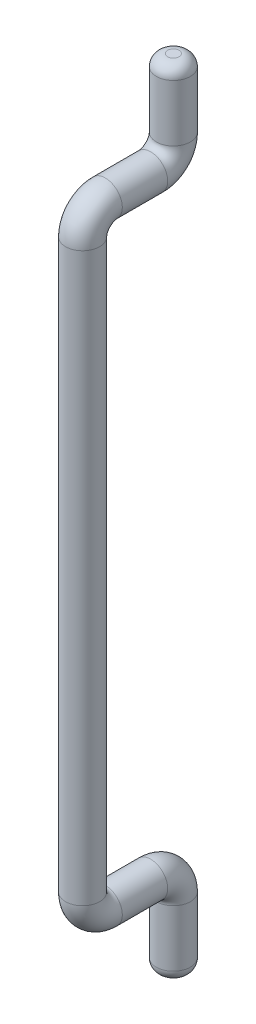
from build123d import *

# Parameters (mm, degrees)
SKETCH2_R = 0.75
FILLET1_R = 0.5


with BuildPart() as part:
    # Sweep1: sweep along a curve in space
    with BuildLine() as sweep1_path:
        Line((0, 0, 0), (0, 3, 0))
        ThreePointArc((0, 3, 0), (0, 3.707106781, 0.292893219), (0, 4, 1))
        Line((0, 4, 1), (0, 4, 3))
        ThreePointArc((0, 4, 3), (0, 4.292893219, 3.707106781), (0, 5, 4))
        Line((0, 5, 4), (0, 30, 4))
        ThreePointArc((0, 30, 4), (0, 30.707106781, 3.707106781), (0, 31, 3))
        Line((0, 31, 3), (0, 31, 1))
        ThreePointArc((0, 31, 1), (0, 31.292893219, 0.292893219), (0, 32, 0))
        Line((0, 32, 0), (0, 35, 0))
    # Sketch2 → Sweep1 (sweep)
    with BuildSketch(Plane(origin=(0, 0, 0), x_dir=(1, 0, 0), z_dir=(0, 1, 0))):
        Circle(SKETCH2_R)
    sweep(path=sweep1_path.line)

    # Fillet1
    fillet1_edges = [part.edges().sort_by_distance(p)[0] for p in [
        (-0.75, 35, 0),
        (-0.75, 0, 0),
    ]]
    fillet(fillet1_edges, radius=FILLET1_R)


solid = part.part
